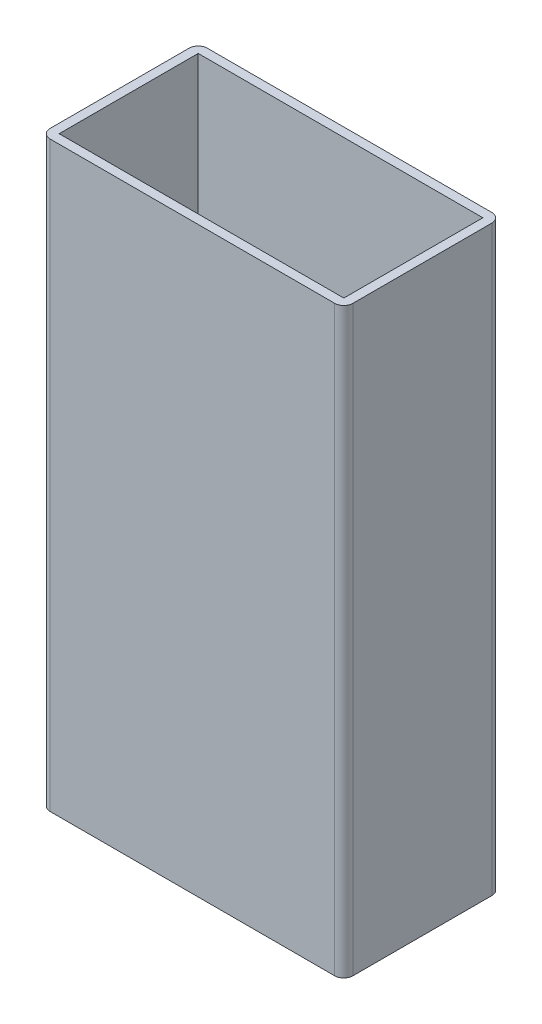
from build123d import *

# Parameters (mm, degrees)
SKETCH1_W           = 49.657
SKETCH1_H           = 24.257
EXTRUDE_THIN1_DEPTH = 101.6


with BuildPart() as part:
    # Sketch1 → Extrude-Thin1 (new body)
    with BuildSketch(Plane(origin=(0, 0, 0), x_dir=(1, 0, 0), z_dir=(0, 1, 0))):
        with BuildLine():
            Line((-26.416, 12.1285), (-26.416, -12.1285))
            ThreePointArc((-26.416, -12.1285), (-25.951032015, -13.251032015), (-24.8285, -13.716))
            Line((-24.8285, -13.716), (24.8285, -13.716))
            ThreePointArc((24.8285, -13.716), (25.951032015, -13.251032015), (26.416, -12.1285))
            Line((26.416, -12.1285), (26.416, 12.1285))
            ThreePointArc((26.416, 12.1285), (25.951032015, 13.251032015), (24.8285, 13.716))
            Line((24.8285, 13.716), (-24.8285, 13.716))
            ThreePointArc((-24.8285, 13.716), (-25.951032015, 13.251032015), (-26.416, 12.1285))
        make_face()
        Rectangle(SKETCH1_W, SKETCH1_H, mode=Mode.SUBTRACT)
    extrude(amount=EXTRUDE_THIN1_DEPTH)


solid = part.part
